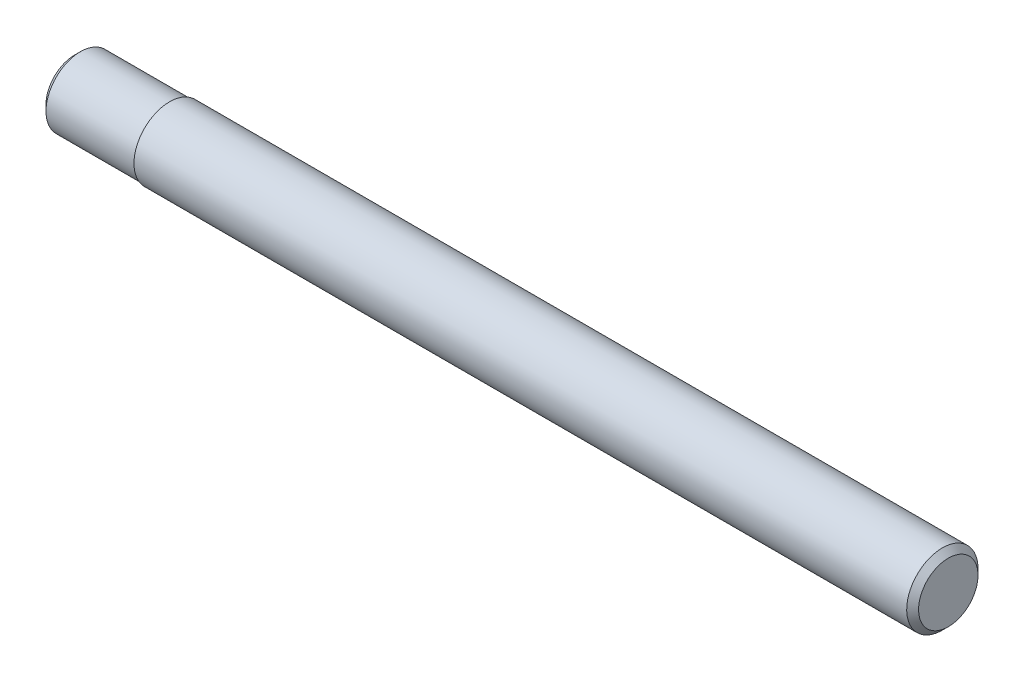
from build123d import *


with BuildPart() as part:
    # Esquisse1 → R_volution1 (revolve)
    with BuildSketch(Plane.XY):
        Polygon((0, 0), (-40.5, 0), (-48.5, 0), (-48.5, 2.4), (-48, 2.9), (-40.5, 2.9), (-40.5, 3), (24.5, 3), (25, 2.5), (25, 0), align=None)
    revolve(axis=Axis((0, 0, 0), (-1, 0, 0)))


solid = part.part
